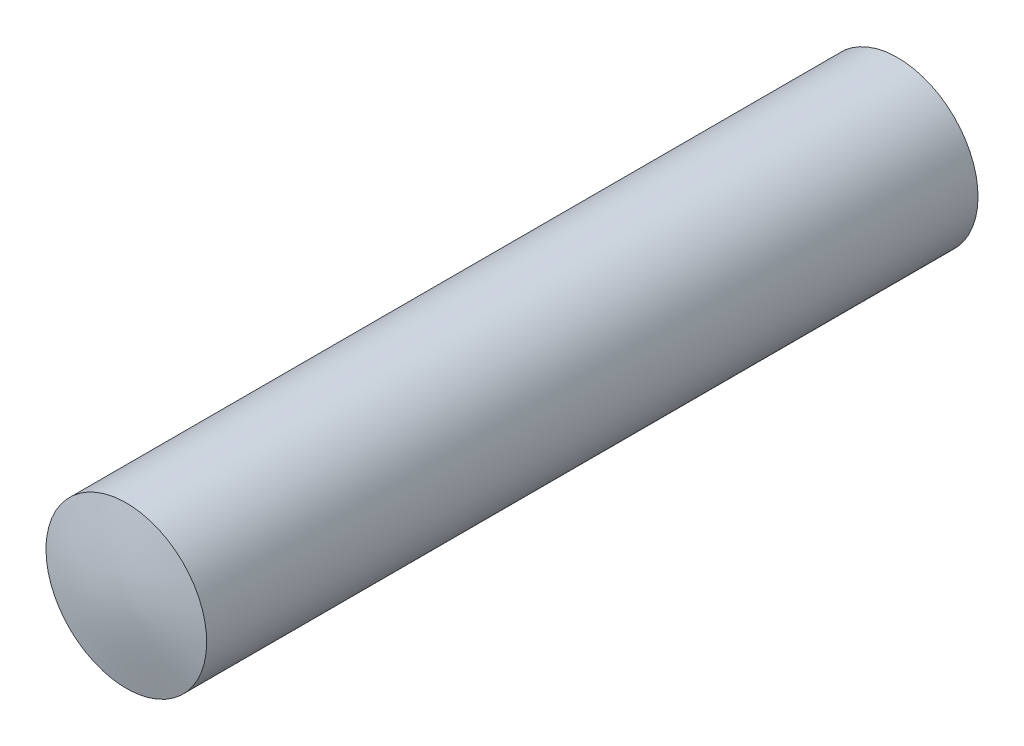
ISO-10303-21;
HEADER;
FILE_DESCRIPTION(('STEP AP214'),'2;1');
FILE_NAME('part.step','',(''),(''),'','','');
FILE_SCHEMA(('AUTOMOTIVE_DESIGN { 1 0 10303 214 1 1 1 1 }'));
ENDSEC;
DATA;
#1=APPLICATION_CONTEXT('core data for automotive mechanical design processes');
#2=APPLICATION_PROTOCOL_DEFINITION('international standard','automotive_design',2000,#1);
#3=PRODUCT_CONTEXT('',#1,'mechanical');
#4=PRODUCT('Part','Part','',(#3));
#5=PRODUCT_RELATED_PRODUCT_CATEGORY('part','',(#4));
#6=PRODUCT_DEFINITION_FORMATION('','',#4);
#7=PRODUCT_DEFINITION_CONTEXT('part definition',#1,'design');
#8=PRODUCT_DEFINITION('design','',#6,#7);
#9=PRODUCT_DEFINITION_SHAPE('','',#8);
#10=(LENGTH_UNIT() NAMED_UNIT(*) SI_UNIT(.MILLI.,.METRE.));
#11=(NAMED_UNIT(*) PLANE_ANGLE_UNIT() SI_UNIT($,.RADIAN.));
#12=(NAMED_UNIT(*) SI_UNIT($,.STERADIAN.) SOLID_ANGLE_UNIT());
#13=UNCERTAINTY_MEASURE_WITH_UNIT(LENGTH_MEASURE(1.E-05),#10,'distance_accuracy_value','');
#14=(GEOMETRIC_REPRESENTATION_CONTEXT(3) GLOBAL_UNCERTAINTY_ASSIGNED_CONTEXT((#13)) GLOBAL_UNIT_ASSIGNED_CONTEXT((#10,
#11,#12)) REPRESENTATION_CONTEXT('',''));
#15=CARTESIAN_POINT('',(0.,0.,0.));
#16=DIRECTION('',(0.,0.,1.));
#17=DIRECTION('',(1.,0.,0.));
#18=AXIS2_PLACEMENT_3D('',#15,#16,#17);
#19=CARTESIAN_POINT('',(0.,0.,7.62));
#20=DIRECTION('',(0.,0.,-1.));
#21=DIRECTION('',(-1.,0.,0.));
#22=AXIS2_PLACEMENT_3D('',#19,#20,#21);
#23=CYLINDRICAL_SURFACE('',#22,1.5875);
#24=CARTESIAN_POINT('',(-1.5875,-1.49262790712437E-11,7.62010571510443));
#25=CARTESIAN_POINT('',(-1.58749604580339,-0.089170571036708,7.62010605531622));
#26=CARTESIAN_POINT('',(-1.57996166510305,-0.178405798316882,7.62011645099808));
#27=CARTESIAN_POINT('',(-1.55001008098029,-0.354418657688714,7.62011473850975));
#28=CARTESIAN_POINT('',(-1.52757496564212,-0.441193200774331,7.62010260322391));
#29=CARTESIAN_POINT('',(-1.46846058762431,-0.609709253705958,7.62010392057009));
#30=CARTESIAN_POINT('',(-1.43178812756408,-0.691453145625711,7.62011736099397));
#31=CARTESIAN_POINT('',(-1.34524940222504,-0.847600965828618,7.62014934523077));
#32=CARTESIAN_POINT('',(-1.29538641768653,-0.922006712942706,7.62016788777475));
#33=CARTESIAN_POINT('',(-1.18387200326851,-1.0614001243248,7.62018769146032));
#34=CARTESIAN_POINT('',(-1.12221934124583,-1.12638680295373,7.62018895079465));
#35=CARTESIAN_POINT('',(-0.988876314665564,-1.24508955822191,7.62017354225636));
#36=CARTESIAN_POINT('',(-0.917185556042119,-1.29880519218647,7.62015687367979));
#37=CARTESIAN_POINT('',(-0.765804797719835,-1.39343708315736,7.62012190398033));
#38=CARTESIAN_POINT('',(-0.686114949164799,-1.43435358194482,7.62010360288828));
#39=CARTESIAN_POINT('',(-0.520997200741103,-1.50222695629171,7.62010309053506));
#40=CARTESIAN_POINT('',(-0.435569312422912,-1.52918385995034,7.62012087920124));
#41=CARTESIAN_POINT('',(-0.26140023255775,-1.56837299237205,7.62014425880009));
#42=CARTESIAN_POINT('',(-0.172659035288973,-1.5806051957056,7.6201498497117));
#43=CARTESIAN_POINT('',(0.00561725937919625,-1.58999759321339,7.6201569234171));
#44=CARTESIAN_POINT('',(0.0951523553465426,-1.58715781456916,7.6201584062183));
#45=CARTESIAN_POINT('',(0.272475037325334,-1.56648691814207,7.6201423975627));
#46=CARTESIAN_POINT('',(0.360262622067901,-1.54865578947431,7.62012490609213));
#47=CARTESIAN_POINT('',(0.531598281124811,-1.4985083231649,7.62010445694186));
#48=CARTESIAN_POINT('',(0.615146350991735,-1.46619197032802,7.62010149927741));
#49=CARTESIAN_POINT('',(0.775631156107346,-1.38799143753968,7.62012015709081));
#50=CARTESIAN_POINT('',(0.852567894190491,-1.34210726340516,7.62014177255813));
#51=CARTESIAN_POINT('',(0.997646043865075,-1.23807361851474,7.62017422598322));
#52=CARTESIAN_POINT('',(1.06578745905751,-1.17992415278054,7.62018506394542));
#53=CARTESIAN_POINT('',(1.19134068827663,-1.05301058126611,7.6201874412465));
#54=CARTESIAN_POINT('',(1.24875249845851,-0.984246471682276,7.62017898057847));
#55=CARTESIAN_POINT('',(1.35121674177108,-0.838055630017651,7.62014913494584));
#56=CARTESIAN_POINT('',(1.3962691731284,-0.760628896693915,7.62012774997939));
#57=CARTESIAN_POINT('',(1.47273574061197,-0.599310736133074,7.62010595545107));
#58=CARTESIAN_POINT('',(1.50414987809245,-0.515419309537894,7.62010554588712));
#59=CARTESIAN_POINT('',(1.55244810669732,-0.343553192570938,7.62010858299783));
#60=CARTESIAN_POINT('',(1.56933219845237,-0.255578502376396,7.62011202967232));
#61=CARTESIAN_POINT('',(1.58809104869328,-0.0780431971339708,7.62011162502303));
#62=CARTESIAN_POINT('',(1.58996580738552,0.0115174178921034,7.62010777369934));
#63=CARTESIAN_POINT('',(1.57865277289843,0.189682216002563,7.62010874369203));
#64=CARTESIAN_POINT('',(1.56546497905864,0.278286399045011,7.6201135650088));
#65=CARTESIAN_POINT('',(1.5244011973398,0.452023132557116,7.62011028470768));
#66=CARTESIAN_POINT('',(1.49652520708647,0.5371556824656,7.62010218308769));
#67=CARTESIAN_POINT('',(1.42687635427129,0.701532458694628,7.62011473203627));
#68=CARTESIAN_POINT('',(1.38510349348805,0.780776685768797,7.62013538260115));
#69=CARTESIAN_POINT('',(1.2888467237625,0.931127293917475,7.62016900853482));
#70=CARTESIAN_POINT('',(1.23436281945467,1.00223367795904,7.62018198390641));
#71=CARTESIAN_POINT('',(1.1142305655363,1.13429016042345,7.62018880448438));
#72=CARTESIAN_POINT('',(1.04858221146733,1.19524025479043,7.62018264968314));
#73=CARTESIAN_POINT('',(0.907984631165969,1.30525393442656,7.6201557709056));
#74=CARTESIAN_POINT('',(0.833035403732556,1.3543175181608,7.62013504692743));
#75=CARTESIAN_POINT('',(0.675963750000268,1.43916535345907,7.62010686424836));
#76=CARTESIAN_POINT('',(0.593841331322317,1.47494961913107,7.62009940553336));
#77=CARTESIAN_POINT('',(0.424754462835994,1.53222307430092,7.62011379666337));
#78=CARTESIAN_POINT('',(0.337790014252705,1.55371226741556,7.62013564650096));
#79=CARTESIAN_POINT('',(0.161487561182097,1.58178560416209,7.62015603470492));
#80=CARTESIAN_POINT('',(0.0721495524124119,1.58836972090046,7.62015457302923));
#81=CARTESIAN_POINT('',(-0.106363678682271,1.58644592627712,7.62015315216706));
#82=CARTESIAN_POINT('',(-0.195538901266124,1.57793803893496,7.62015319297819));
#83=CARTESIAN_POINT('',(-0.371195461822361,1.54607175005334,7.62013109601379));
#84=CARTESIAN_POINT('',(-0.457676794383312,1.52271331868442,7.62010895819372));
#85=CARTESIAN_POINT('',(-0.625491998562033,1.46180847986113,7.62009876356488));
#86=CARTESIAN_POINT('',(-0.706825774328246,1.42426180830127,7.62011070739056));
#87=CARTESIAN_POINT('',(-0.862032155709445,1.3360479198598,7.62014233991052));
#88=CARTESIAN_POINT('',(-0.935905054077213,1.28538121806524,7.62016202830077));
#89=CARTESIAN_POINT('',(-1.07408901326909,1.17237158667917,7.62018551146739));
#90=CARTESIAN_POINT('',(-1.13840107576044,1.11002988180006,7.62018930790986));
#91=CARTESIAN_POINT('',(-1.25566240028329,0.975416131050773,7.62017809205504));
#92=CARTESIAN_POINT('',(-1.30860883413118,0.903141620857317,7.62016307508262));
#93=CARTESIAN_POINT('',(-1.40163627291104,0.75070131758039,7.62012917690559));
#94=CARTESIAN_POINT('',(-1.44171112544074,0.670531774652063,7.62011029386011));
#95=CARTESIAN_POINT('',(-1.50778654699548,0.504665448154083,7.62010167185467));
#96=CARTESIAN_POINT('',(-1.53380398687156,0.418975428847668,7.62011189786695));
#97=CARTESIAN_POINT('',(-1.56409188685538,0.277282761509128,7.6201159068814));
#98=CARTESIAN_POINT('',(-1.57285897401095,0.222200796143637,7.62011441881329));
#99=CARTESIAN_POINT('',(-1.58456426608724,0.111420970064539,7.62010921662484));
#100=CARTESIAN_POINT('',(-1.58750247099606,0.0557231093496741,7.62010550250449));
#101=CARTESIAN_POINT('',(-1.5875,-1.49262790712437E-11,7.62010571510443));
#102=B_SPLINE_CURVE_WITH_KNOTS('',3,(#24,#25,#26,#27,#28,#29,#30,#31,#32,#33,#34,#35,#36,#37,
#38,#39,#40,#41,#42,#43,#44,#45,#46,#47,#48,#49,#50,#51,#52,#53,#54,#55,#56,#57,#58,#59,#60,#61,
#62,#63,#64,#65,#66,#67,#68,#69,#70,#71,#72,#73,#74,#75,#76,#77,#78,#79,#80,#81,#82,#83,#84,#85,
#86,#87,#88,#89,#90,#91,#92,#93,#94,#95,#96,#97,#98,#99,#100,#101),.UNSPECIFIED.,.T.,.F.,(4,2,2,
2,2,2,2,2,2,2,2,2,2,2,2,2,2,2,2,2,2,2,2,2,2,2,2,2,2,2,2,2,2,2,2,2,2,2,4),(0.,0.267308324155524,
0.534938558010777,0.802441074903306,1.06987712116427,1.33734113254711,1.60481564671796,
1.87228510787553,2.13975403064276,2.40722341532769,2.67469231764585,2.94216141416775,
3.20963079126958,3.4771000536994,3.74456920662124,4.01203845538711,4.27950774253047,
4.54697700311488,4.8144462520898,5.08191549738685,5.34938475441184,5.61685405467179,
5.88432332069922,6.15179248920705,6.41926176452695,6.68673107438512,6.95420010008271,
7.22166905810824,7.48913849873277,7.75660751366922,8.02407706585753,8.29155159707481,
8.55901562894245,8.8264516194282,9.09395408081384,9.36158421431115,9.628892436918,
9.79593466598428,9.96297689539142),.UNSPECIFIED.);
#103=CARTESIAN_POINT('',(-1.5875,-1.49262790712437E-11,7.62010571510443));
#104=VERTEX_POINT('',#103);
#105=EDGE_CURVE('E12',#104,#104,#102,.T.);
#106=ORIENTED_EDGE('',*,*,#105,.F.);
#107=EDGE_LOOP('',(#106));
#108=FACE_BOUND('',#107,.T.);
#109=CARTESIAN_POINT('',(-1.5875,1.50157121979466E-11,-7.62010571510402));
#110=CARTESIAN_POINT('',(-1.58749604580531,-0.0891705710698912,-7.62010608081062));
#111=CARTESIAN_POINT('',(-1.57996166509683,-0.178405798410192,-7.62011650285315));
#112=CARTESIAN_POINT('',(-1.55001008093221,-0.35441865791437,-7.62011489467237));
#113=CARTESIAN_POINT('',(-1.52757496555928,-0.441193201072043,-7.62010283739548));
#114=CARTESIAN_POINT('',(-1.46846058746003,-0.60970925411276,-7.620104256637));
#115=CARTESIAN_POINT('',(-1.43178812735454,-0.691453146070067,-7.62011772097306));
#116=CARTESIAN_POINT('',(-1.34524940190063,-0.847600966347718,-7.62014965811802));
#117=CARTESIAN_POINT('',(-1.29538641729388,-0.922006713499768,-7.62016812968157));
#118=CARTESIAN_POINT('',(-1.18387200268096,-1.06140012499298,-7.62018774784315));
#119=CARTESIAN_POINT('',(-1.12221934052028,-1.12638680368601,-7.62018889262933));
#120=CARTESIAN_POINT('',(-0.988876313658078,-1.24508955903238,-7.620173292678));
#121=CARTESIAN_POINT('',(-0.91718555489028,-1.29880519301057,-7.620156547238));
#122=CARTESIAN_POINT('',(-0.765804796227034,-1.39343708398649,-7.62012151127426));
#123=CARTESIAN_POINT('',(-0.686114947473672,-1.43435358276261,-7.62010322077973));
#124=CARTESIAN_POINT('',(-0.520997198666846,-1.50222695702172,-7.62010279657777));
#125=CARTESIAN_POINT('',(-0.435569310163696,-1.52918386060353,-7.62012066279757));
#126=CARTESIAN_POINT('',(-0.261400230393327,-1.56837299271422,-7.62014416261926));
#127=CARTESIAN_POINT('',(-0.172659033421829,-1.58060519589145,-7.6201497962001));
#128=CARTESIAN_POINT('',(0.00561726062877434,-1.58999759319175,-7.6201569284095));
#129=CARTESIAN_POINT('',(0.0951523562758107,-1.58715781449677,-7.62015842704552));
#130=CARTESIAN_POINT('',(0.272475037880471,-1.56648691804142,-7.62014249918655));
#131=CARTESIAN_POINT('',(0.360262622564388,-1.54865578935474,-7.62012507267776));
#132=CARTESIAN_POINT('',(0.531598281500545,-1.49850832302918,-7.62010474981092));
#133=CARTESIAN_POINT('',(0.61514635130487,-1.4661919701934,-7.62010185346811));
#134=CARTESIAN_POINT('',(0.77563115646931,-1.38799143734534,-7.62012054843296));
#135=CARTESIAN_POINT('',(0.852567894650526,-1.3421072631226,-7.62014213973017));
#136=CARTESIAN_POINT('',(0.99764604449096,-1.23807361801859,-7.62017446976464));
#137=CARTESIAN_POINT('',(1.06578745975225,-1.17992415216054,-7.62018520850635));
#138=CARTESIAN_POINT('',(1.19134068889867,-1.05301058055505,-7.62018737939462));
#139=CARTESIAN_POINT('',(1.24875249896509,-0.984246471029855,-7.62017881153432));
#140=CARTESIAN_POINT('',(1.35121674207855,-0.838055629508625,-7.62014881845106));
#141=CARTESIAN_POINT('',(1.39626917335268,-0.760628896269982,-7.62012739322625));
#142=CARTESIAN_POINT('',(1.47273574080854,-0.59931073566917,-7.6201056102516));
#143=CARTESIAN_POINT('',(1.50414987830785,-0.515419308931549,-7.62010525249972));
#144=CARTESIAN_POINT('',(1.55244810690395,-0.34355319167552,-7.62010840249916));
#145=CARTESIAN_POINT('',(1.56933219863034,-0.255578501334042,-7.62011191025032));
#146=CARTESIAN_POINT('',(1.58809104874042,-0.0780431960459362,-7.62011159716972));
#147=CARTESIAN_POINT('',(1.5899658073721,0.0115174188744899,-7.62010777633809));
#148=CARTESIAN_POINT('',(1.57865277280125,0.189682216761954,-7.62010882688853));
#149=CARTESIAN_POINT('',(1.56546497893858,0.278286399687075,-7.62011369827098));
#150=CARTESIAN_POINT('',(1.52440119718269,0.452023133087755,-7.62011053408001));
#151=CARTESIAN_POINT('',(1.49652520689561,0.537155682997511,-7.62010249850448));
#152=CARTESIAN_POINT('',(1.42687635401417,0.701532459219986,-7.62011509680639));
#153=CARTESIAN_POINT('',(1.3851034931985,0.78077668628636,-7.62013573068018));
#154=CARTESIAN_POINT('',(1.28884672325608,0.931127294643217,-7.62016924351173));
#155=CARTESIAN_POINT('',(1.23436281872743,1.00223367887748,-7.6201821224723));
#156=CARTESIAN_POINT('',(1.11423056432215,1.13429016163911,-7.62018873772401));
#157=CARTESIAN_POINT('',(1.04858220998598,1.19524025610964,-7.62018247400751));
#158=CARTESIAN_POINT('',(0.907984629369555,1.30525393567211,-7.62015543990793));
#159=CARTESIAN_POINT('',(0.833035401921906,1.35431751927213,-7.62013466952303));
#160=CARTESIAN_POINT('',(0.675963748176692,1.4391653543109,-7.62010648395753));
#161=CARTESIAN_POINT('',(0.593841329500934,1.47494961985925,-7.62009906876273));
#162=CARTESIAN_POINT('',(0.424754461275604,1.53222307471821,-7.62011357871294));
#163=CARTESIAN_POINT('',(0.337790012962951,1.55371226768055,-7.62013550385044));
#164=CARTESIAN_POINT('',(0.161487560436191,1.58178560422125,-7.62015599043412));
#165=CARTESIAN_POINT('',(0.0721495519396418,1.58836972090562,-7.62015455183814));
#166=CARTESIAN_POINT('',(-0.10636367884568,1.5864459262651,-7.62015318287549));
#167=CARTESIAN_POINT('',(-0.195538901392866,1.57793803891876,-7.62015325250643));
#168=CARTESIAN_POINT('',(-0.371195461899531,1.54607175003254,-7.62013126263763));
#169=CARTESIAN_POINT('',(-0.457676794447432,1.52271331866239,-7.62010920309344));
#170=CARTESIAN_POINT('',(-0.62549199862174,1.46180847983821,-7.62009911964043));
#171=CARTESIAN_POINT('',(-0.706825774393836,1.42426180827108,-7.62011109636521));
#172=CARTESIAN_POINT('',(-0.862032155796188,1.3360479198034,-7.62014270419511));
#173=CARTESIAN_POINT('',(-0.935905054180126,1.28538121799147,-7.62016233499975));
#174=CARTESIAN_POINT('',(-1.07408901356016,1.17237158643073,-7.62018564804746));
#175=CARTESIAN_POINT('',(-1.13840107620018,1.11002988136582,-7.62018933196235));
#176=CARTESIAN_POINT('',(-1.25566240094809,0.975416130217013,-7.62017791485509));
#177=CARTESIAN_POINT('',(-1.30860883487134,0.903141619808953,-7.62016280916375));
#178=CARTESIAN_POINT('',(-1.40163627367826,0.750701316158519,-7.62012882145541));
#179=CARTESIAN_POINT('',(-1.44171112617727,0.670531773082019,-7.62010993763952));
#180=CARTESIAN_POINT('',(-1.50778654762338,0.504665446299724,-7.6201013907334));
#181=CARTESIAN_POINT('',(-1.53380398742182,0.418975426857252,-7.62011169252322));
#182=CARTESIAN_POINT('',(-1.56409188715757,0.277282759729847,-7.62011579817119));
#183=CARTESIAN_POINT('',(-1.57285897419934,0.222200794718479,-7.62011434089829));
#184=CARTESIAN_POINT('',(-1.58456426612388,0.111420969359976,-7.62010918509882));
#185=CARTESIAN_POINT('',(-1.58750247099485,0.0557231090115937,-7.62010548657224));
#186=CARTESIAN_POINT('',(-1.5875,1.50157121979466E-11,-7.62010571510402));
#187=B_SPLINE_CURVE_WITH_KNOTS('',3,(#109,#110,#111,#112,#113,#114,#115,#116,#117,#118,#119,
#120,#121,#122,#123,#124,#125,#126,#127,#128,#129,#130,#131,#132,#133,#134,#135,#136,#137,#138,
#139,#140,#141,#142,#143,#144,#145,#146,#147,#148,#149,#150,#151,#152,#153,#154,#155,#156,#157,
#158,#159,#160,#161,#162,#163,#164,#165,#166,#167,#168,#169,#170,#171,#172,#173,#174,#175,#176,
#177,#178,#179,#180,#181,#182,#183,#184,#185,#186),.UNSPECIFIED.,.T.,.F.,(4,2,2,2,2,2,2,2,2,2,2,
2,2,2,2,2,2,2,2,2,2,2,2,2,2,2,2,2,2,2,2,2,2,2,2,2,2,2,4),(0.,0.267308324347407,
0.534938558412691,0.802441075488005,1.06987712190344,1.33734113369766,1.60481564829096,
1.87228510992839,2.13975403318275,2.40722341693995,2.6746923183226,2.94216141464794,
3.20963079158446,3.47710005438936,3.74456920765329,4.01203845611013,4.27950774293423,
4.54697700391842,4.81444625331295,5.08191549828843,5.34938475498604,5.61685405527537,
5.88432332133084,6.15179249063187,6.41926176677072,6.68673107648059,6.95420010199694,
7.22166905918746,7.48913849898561,7.756607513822,8.02407706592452,8.29155159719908,
8.55901562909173,8.82645162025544,9.09395408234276,9.36158421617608,9.62889243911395,
9.79593466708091,9.96297689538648),.UNSPECIFIED.);
#188=CARTESIAN_POINT('',(-1.5875,1.50157121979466E-11,-7.62010571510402));
#189=VERTEX_POINT('',#188);
#190=EDGE_CURVE('E107',#189,#189,#187,.T.);
#191=ORIENTED_EDGE('',*,*,#190,.T.);
#192=EDGE_LOOP('',(#191));
#193=FACE_BOUND('',#192,.T.);
#194=ADVANCED_FACE('F93',(#108,#193),#23,.T.);
#195=CARTESIAN_POINT('',(1.68852205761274,-1.61923509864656,7.46647886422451));
#196=CARTESIAN_POINT('',(1.41835918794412,-1.61923509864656,7.50349513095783));
#197=CARTESIAN_POINT('',(1.1481963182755,-1.61923509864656,7.53716691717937));
#198=CARTESIAN_POINT('',(0.878033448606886,-1.61923509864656,7.56853974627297));
#199=CARTESIAN_POINT('',(0.472788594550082,-1.61923509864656,7.60455187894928));
#200=CARTESIAN_POINT('',(0.0675437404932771,-1.61923509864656,7.61450699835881));
#201=CARTESIAN_POINT('',(-0.0675382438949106,-1.61923509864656,7.61450705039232));
#202=CARTESIAN_POINT('',(-0.472784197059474,-1.61923509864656,7.60455237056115));
#203=CARTESIAN_POINT('',(-0.878030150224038,-1.61923509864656,7.56854089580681));
#204=CARTESIAN_POINT('',(-1.14819411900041,-1.61923509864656,7.53716801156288));
#205=CARTESIAN_POINT('',(-1.41835808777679,-1.61923509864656,7.50349578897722));
#206=CARTESIAN_POINT('',(-1.68852205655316,-1.61923509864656,7.46647897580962));
#207=CARTESIAN_POINT('',(1.68852205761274,-1.3601581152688,7.49956971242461));
#208=CARTESIAN_POINT('',(1.41835918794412,-1.3601581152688,7.54241339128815));
#209=CARTESIAN_POINT('',(1.1481963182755,-1.3601581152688,7.58186378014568));
#210=CARTESIAN_POINT('',(0.878033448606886,-1.3601581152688,7.61925920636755));
#211=CARTESIAN_POINT('',(0.472788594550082,-1.3601581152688,7.66243648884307));
#212=CARTESIAN_POINT('',(0.0675437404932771,-1.3601581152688,7.6743944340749));
#213=CARTESIAN_POINT('',(-0.0675382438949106,-1.3601581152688,7.67439451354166));
#214=CARTESIAN_POINT('',(-0.472784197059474,-1.3601581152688,7.66243705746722));
#215=CARTESIAN_POINT('',(-0.878030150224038,-1.3601581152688,7.6192602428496));
#216=CARTESIAN_POINT('',(-1.14819411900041,-1.3601581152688,7.58186447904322));
#217=CARTESIAN_POINT('',(-1.41835808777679,-1.3601581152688,7.54241361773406));
#218=CARTESIAN_POINT('',(-1.68852205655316,-1.3601581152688,7.49956935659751));
#219=CARTESIAN_POINT('',(1.68852205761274,-1.10108113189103,7.52958784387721));
#220=CARTESIAN_POINT('',(1.41835918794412,-1.10108113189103,7.57821300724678));
#221=CARTESIAN_POINT('',(1.1481963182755,-1.10108113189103,7.62334626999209));
#222=CARTESIAN_POINT('',(0.878033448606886,-1.10108113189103,7.6669804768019));
#223=CARTESIAN_POINT('',(0.472788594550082,-1.10108113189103,7.71755669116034));
#224=CARTESIAN_POINT('',(0.0675437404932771,-1.10108113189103,7.73158371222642));
#225=CARTESIAN_POINT('',(-0.0675382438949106,-1.10108113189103,7.73158380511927));
#226=CARTESIAN_POINT('',(-0.472784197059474,-1.10108113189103,7.71755739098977));
#227=CARTESIAN_POINT('',(-0.878030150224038,-1.10108113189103,7.66698130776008));
#228=CARTESIAN_POINT('',(-1.14819411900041,-1.10108113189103,7.62334665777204));
#229=CARTESIAN_POINT('',(-1.41835808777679,-1.10108113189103,7.57821287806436));
#230=CARTESIAN_POINT('',(-1.68852205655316,-1.10108113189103,7.52958709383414));
#231=CARTESIAN_POINT('',(1.68852205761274,-0.842004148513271,7.55746306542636));
#232=CARTESIAN_POINT('',(1.41835918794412,-0.842004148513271,7.61212603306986));
#233=CARTESIAN_POINT('',(1.1481963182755,-0.842004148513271,7.66347618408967));
#234=CARTESIAN_POINT('',(0.878033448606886,-0.842004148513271,7.71390778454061));
#235=CARTESIAN_POINT('',(0.472788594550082,-0.842004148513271,7.77144811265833));
#236=CARTESIAN_POINT('',(0.0675437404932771,-0.842004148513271,7.78758952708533));
#237=CARTESIAN_POINT('',(-0.0675382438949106,-0.842004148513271,7.78758963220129));
#238=CARTESIAN_POINT('',(-0.472784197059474,-0.842004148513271,7.77144871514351));
#239=CARTESIAN_POINT('',(-0.878030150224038,-0.842004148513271,7.7139084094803));
#240=CARTESIAN_POINT('',(-1.14819411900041,-0.842004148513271,7.66347626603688));
#241=CARTESIAN_POINT('',(-1.41835808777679,-0.842004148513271,7.61212566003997));
#242=CARTESIAN_POINT('',(-1.68852205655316,-0.842004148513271,7.557462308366));
#243=CARTESIAN_POINT('',(1.68852205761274,-0.453388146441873,7.58919472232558));
#244=CARTESIAN_POINT('',(1.41835918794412,-0.453388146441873,7.65114261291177));
#245=CARTESIAN_POINT('',(1.1481963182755,-0.453388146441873,7.71004858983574));
#246=CARTESIAN_POINT('',(0.878033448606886,-0.453388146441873,7.7675507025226));
#247=CARTESIAN_POINT('',(0.472788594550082,-0.453388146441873,7.83835259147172));
#248=CARTESIAN_POINT('',(0.0675437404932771,-0.453388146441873,7.85853533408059));
#249=CARTESIAN_POINT('',(-0.0675382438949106,-0.453388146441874,7.85853544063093));
#250=CARTESIAN_POINT('',(-0.472784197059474,-0.453388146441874,7.83835327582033));
#251=CARTESIAN_POINT('',(-0.878030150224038,-0.453388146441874,7.76755132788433));
#252=CARTESIAN_POINT('',(-1.14819411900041,-0.453388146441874,7.71004885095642));
#253=CARTESIAN_POINT('',(-1.41835808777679,-0.453388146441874,7.6511427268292));
#254=CARTESIAN_POINT('',(-1.68852205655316,-0.453388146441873,7.58919455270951));
#255=CARTESIAN_POINT('',(1.68852205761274,-0.064772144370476,7.59788540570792));
#256=CARTESIAN_POINT('',(1.41835918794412,-0.064772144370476,7.66189021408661));
#257=CARTESIAN_POINT('',(1.1481963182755,-0.064772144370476,7.72296639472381));
#258=CARTESIAN_POINT('',(0.878033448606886,-0.064772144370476,7.78262864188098));
#259=CARTESIAN_POINT('',(0.472788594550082,-0.064772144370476,7.85748386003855));
#260=CARTESIAN_POINT('',(0.0675437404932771,-0.064772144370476,7.8806462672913));
#261=CARTESIAN_POINT('',(-0.0675382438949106,-0.064772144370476,7.88064640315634));
#262=CARTESIAN_POINT('',(-0.472784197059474,-0.064772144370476,7.85748460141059));
#263=CARTESIAN_POINT('',(-0.878030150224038,-0.064772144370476,7.78262936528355));
#264=CARTESIAN_POINT('',(-1.14819411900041,-0.064772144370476,7.72296688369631));
#265=CARTESIAN_POINT('',(-1.41835808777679,-0.064772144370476,7.66189045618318));
#266=CARTESIAN_POINT('',(-1.68852205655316,-0.064772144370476,7.597885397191));
#267=CARTESIAN_POINT('',(1.68852205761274,0.064766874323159,7.59788543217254));
#268=CARTESIAN_POINT('',(1.41835918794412,0.064766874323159,7.66189024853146));
#269=CARTESIAN_POINT('',(1.1481963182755,0.064766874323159,7.72296646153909));
#270=CARTESIAN_POINT('',(0.878033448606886,0.064766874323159,7.78262870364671));
#271=CARTESIAN_POINT('',(0.472788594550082,0.064766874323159,7.85748396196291));
#272=CARTESIAN_POINT('',(0.0675437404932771,0.064766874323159,7.88064639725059));
#273=CARTESIAN_POINT('',(-0.0675382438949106,0.064766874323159,7.88064653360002));
#274=CARTESIAN_POINT('',(-0.472784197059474,0.064766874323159,7.85748470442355));
#275=CARTESIAN_POINT('',(-0.878030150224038,0.064766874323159,7.78262946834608));
#276=CARTESIAN_POINT('',(-1.14819411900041,0.064766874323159,7.72296696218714));
#277=CARTESIAN_POINT('',(-1.41835808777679,0.064766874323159,7.66189052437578));
#278=CARTESIAN_POINT('',(-1.68852205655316,0.064766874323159,7.59788544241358));
#279=CARTESIAN_POINT('',(1.68852205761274,0.453383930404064,7.5891948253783));
#280=CARTESIAN_POINT('',(1.41835918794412,0.453383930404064,7.65114283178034));
#281=CARTESIAN_POINT('',(1.1481963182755,0.453383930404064,7.71004881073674));
#282=CARTESIAN_POINT('',(0.878033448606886,0.453383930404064,7.7675511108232));
#283=CARTESIAN_POINT('',(0.472788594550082,0.453383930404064,7.83835323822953));
#284=CARTESIAN_POINT('',(0.0675437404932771,0.453383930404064,7.858536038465));
#285=CARTESIAN_POINT('',(-0.0675382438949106,0.453383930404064,7.85853614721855));
#286=CARTESIAN_POINT('',(-0.472784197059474,0.453383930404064,7.83835393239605));
#287=CARTESIAN_POINT('',(-0.878030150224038,0.453383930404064,7.76755192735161));
#288=CARTESIAN_POINT('',(-1.14819411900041,0.453383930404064,7.7100495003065));
#289=CARTESIAN_POINT('',(-1.41835808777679,0.453383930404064,7.65114322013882));
#290=CARTESIAN_POINT('',(-1.68852205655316,0.453383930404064,7.58919499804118));
#291=CARTESIAN_POINT('',(1.68852205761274,0.842000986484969,7.55746265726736));
#292=CARTESIAN_POINT('',(1.41835918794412,0.842000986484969,7.61212586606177));
#293=CARTESIAN_POINT('',(1.1481963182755,0.842000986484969,7.66347635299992));
#294=CARTESIAN_POINT('',(0.878033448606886,0.842000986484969,7.71390836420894));
#295=CARTESIAN_POINT('',(0.472788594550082,0.842000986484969,7.77144885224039));
#296=CARTESIAN_POINT('',(0.0675437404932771,0.842000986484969,7.78759024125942));
#297=CARTESIAN_POINT('',(-0.0675382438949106,0.842000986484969,7.78759031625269));
#298=CARTESIAN_POINT('',(-0.472784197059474,0.842000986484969,7.77144932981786));
#299=CARTESIAN_POINT('',(-0.878030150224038,0.842000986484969,7.71390899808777));
#300=CARTESIAN_POINT('',(-1.14819411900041,0.842000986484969,7.6634771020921));
#301=CARTESIAN_POINT('',(-1.41835808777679,0.842000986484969,7.61212668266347));
#302=CARTESIAN_POINT('',(-1.68852205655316,0.842000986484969,7.55746341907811));
#303=CARTESIAN_POINT('',(1.68852205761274,1.10107902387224,7.52958733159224));
#304=CARTESIAN_POINT('',(1.41835918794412,1.10107902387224,7.57821296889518));
#305=CARTESIAN_POINT('',(1.1481963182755,1.10107902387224,7.62334662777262));
#306=CARTESIAN_POINT('',(0.878033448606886,1.10107902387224,7.66698115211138));
#307=CARTESIAN_POINT('',(0.472788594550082,1.10107902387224,7.71755735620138));
#308=CARTESIAN_POINT('',(0.0675437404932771,1.10107902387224,7.7315841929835));
#309=CARTESIAN_POINT('',(-0.0675382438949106,1.10107902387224,7.73158425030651));
#310=CARTESIAN_POINT('',(-0.472784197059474,1.10107902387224,7.71755761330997));
#311=CARTESIAN_POINT('',(-0.878030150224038,1.10107902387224,7.66698140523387));
#312=CARTESIAN_POINT('',(-1.14819411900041,1.10107902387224,7.62334696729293));
#313=CARTESIAN_POINT('',(-1.41835808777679,1.10107902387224,7.57821348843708));
#314=CARTESIAN_POINT('',(-1.68852205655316,1.10107902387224,7.52958808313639));
#315=CARTESIAN_POINT('',(1.68852205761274,1.36015706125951,7.49956948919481));
#316=CARTESIAN_POINT('',(1.41835918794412,1.36015706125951,7.5424136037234));
#317=CARTESIAN_POINT('',(1.1481963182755,1.36015706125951,7.58186434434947));
#318=CARTESIAN_POINT('',(0.878033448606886,1.36015706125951,7.61925998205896));
#319=CARTESIAN_POINT('',(0.472788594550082,1.36015706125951,7.66243688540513));
#320=CARTESIAN_POINT('',(0.0675437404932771,1.36015706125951,7.67439468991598));
#321=CARTESIAN_POINT('',(-0.0675382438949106,1.36015706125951,7.67439474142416));
#322=CARTESIAN_POINT('',(-0.472784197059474,1.36015706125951,7.6624371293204));
#323=CARTESIAN_POINT('',(-0.878030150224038,1.36015706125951,7.6192598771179));
#324=CARTESIAN_POINT('',(-1.14819411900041,1.36015706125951,7.58186427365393));
#325=CARTESIAN_POINT('',(-1.41835808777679,1.36015706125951,7.54241371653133));
#326=CARTESIAN_POINT('',(-1.68852205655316,1.36015706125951,7.49956984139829));
#327=CARTESIAN_POINT('',(1.68852205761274,1.61923509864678,7.46647897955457));
#328=CARTESIAN_POINT('',(1.41835918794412,1.61923509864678,7.50349564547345));
#329=CARTESIAN_POINT('',(1.1481963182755,1.61923509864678,7.53716774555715));
#330=CARTESIAN_POINT('',(0.878033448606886,1.61923509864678,7.56854050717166));
#331=CARTESIAN_POINT('',(0.472788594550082,1.61923509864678,7.60455203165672));
#332=CARTESIAN_POINT('',(0.0675437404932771,1.61923509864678,7.61450699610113));
#333=CARTESIAN_POINT('',(-0.0675382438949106,1.61923509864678,7.61450705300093));
#334=CARTESIAN_POINT('',(-0.472784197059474,1.61923509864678,7.6045522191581));
#335=CARTESIAN_POINT('',(-0.878030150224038,1.61923509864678,7.56854013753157));
#336=CARTESIAN_POINT('',(-1.14819411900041,1.61923509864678,7.5371671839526));
#337=CARTESIAN_POINT('',(-1.41835808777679,1.61923509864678,7.50349527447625));
#338=CARTESIAN_POINT('',(-1.68852205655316,1.61923509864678,7.46647885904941));
#339=B_SPLINE_SURFACE_WITH_KNOTS('',5,5,((#195,#196,#197,#198,#199,#200,#201,#202,#203,#204,
#205,#206),(#207,#208,#209,#210,#211,#212,#213,#214,#215,#216,#217,#218),(#219,#220,#221,#222,
#223,#224,#225,#226,#227,#228,#229,#230),(#231,#232,#233,#234,#235,#236,#237,#238,#239,#240,
#241,#242),(#243,#244,#245,#246,#247,#248,#249,#250,#251,#252,#253,#254),(#255,#256,#257,#258,
#259,#260,#261,#262,#263,#264,#265,#266),(#267,#268,#269,#270,#271,#272,#273,#274,#275,#276,
#277,#278),(#279,#280,#281,#282,#283,#284,#285,#286,#287,#288,#289,#290),(#291,#292,#293,#294,
#295,#296,#297,#298,#299,#300,#301,#302),(#303,#304,#305,#306,#307,#308,#309,#310,#311,#312,
#313,#314),(#315,#316,#317,#318,#319,#320,#321,#322,#323,#324,#325,#326),(#327,#328,#329,#330,
#331,#332,#333,#334,#335,#336,#337,#338)),.UNSPECIFIED.,.F.,.F.,.F.,(6,3,3,6),(6,3,3,6),
(-1.6192350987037,-0.323850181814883,0.323844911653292,1.61923509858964),(-1.68852205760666,
-0.337707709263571,0.337702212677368,1.68852205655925),.UNSPECIFIED.);
#340=ORIENTED_EDGE('',*,*,#105,.T.);
#341=EDGE_LOOP('',(#340));
#342=FACE_BOUND('',#341,.T.);
#343=ADVANCED_FACE('F95',(#342),#339,.T.);
#344=CARTESIAN_POINT('',(1.6885220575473,-1.61923509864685,-7.46647898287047));
#345=CARTESIAN_POINT('',(1.41835918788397,-1.61923509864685,-7.50349564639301));
#346=CARTESIAN_POINT('',(1.14819631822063,-1.61923509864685,-7.53716774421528));
#347=CARTESIAN_POINT('',(0.878033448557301,-1.61923509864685,-7.56854050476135));
#348=CARTESIAN_POINT('',(0.472788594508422,-1.61923509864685,-7.60455203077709));
#349=CARTESIAN_POINT('',(0.0675437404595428,-1.61923509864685,-7.61450699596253));
#350=CARTESIAN_POINT('',(-0.0675382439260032,-1.61923509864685,-7.6145070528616));
#351=CARTESIAN_POINT('',(-0.472784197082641,-1.61923509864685,-7.60455221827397));
#352=CARTESIAN_POINT('',(-0.878030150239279,-1.61923509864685,-7.56854013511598));
#353=CARTESIAN_POINT('',(-1.14819411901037,-1.61923509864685,-7.53716718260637));
#354=CARTESIAN_POINT('',(-1.41835808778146,-1.61923509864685,-7.50349527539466));
#355=CARTESIAN_POINT('',(-1.68852205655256,-1.61923509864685,-7.46647886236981));
#356=CARTESIAN_POINT('',(1.6885220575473,-1.36015811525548,-7.4995693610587));
#357=CARTESIAN_POINT('',(1.41835918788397,-1.36015811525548,-7.54241344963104));
#358=CARTESIAN_POINT('',(1.14819631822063,-1.36015811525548,-7.58186416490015));
#359=CARTESIAN_POINT('',(0.8780334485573,-1.36015811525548,-7.61925977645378));
#360=CARTESIAN_POINT('',(0.472788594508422,-1.36015811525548,-7.66243665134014));
#361=CARTESIAN_POINT('',(0.0675437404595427,-1.36015811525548,-7.67439444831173));
#362=CARTESIAN_POINT('',(-0.0675382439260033,-1.36015811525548,-7.67439449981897));
#363=CARTESIAN_POINT('',(-0.472784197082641,-1.36015811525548,-7.66243689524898));
#364=CARTESIAN_POINT('',(-0.87803015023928,-1.36015811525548,-7.61925967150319));
#365=CARTESIAN_POINT('',(-1.14819411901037,-1.36015811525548,-7.58186409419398));
#366=CARTESIAN_POINT('',(-1.41835808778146,-1.36015811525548,-7.5424135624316));
#367=CARTESIAN_POINT('',(-1.68852205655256,-1.36015811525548,-7.49956971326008));
#368=CARTESIAN_POINT('',(1.6885220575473,-1.10108113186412,-7.5295870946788));
#369=CARTESIAN_POINT('',(1.41835918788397,-1.10108113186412,-7.57821268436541));
#370=CARTESIAN_POINT('',(1.14819631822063,-1.10108113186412,-7.62334629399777));
#371=CARTESIAN_POINT('',(0.8780334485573,-1.10108113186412,-7.66698076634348));
#372=CARTESIAN_POINT('',(0.472788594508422,-1.10108113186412,-7.71755691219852));
#373=CARTESIAN_POINT('',(0.0675437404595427,-1.10108113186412,-7.73158373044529));
#374=CARTESIAN_POINT('',(-0.0675382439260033,-1.10108113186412,-7.73158378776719));
#375=CARTESIAN_POINT('',(-0.472784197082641,-1.10108113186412,-7.71755716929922));
#376=CARTESIAN_POINT('',(-0.87803015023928,-1.10108113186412,-7.66698101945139));
#377=CARTESIAN_POINT('',(-1.14819411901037,-1.10108113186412,-7.62334663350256));
#378=CARTESIAN_POINT('',(-1.41835808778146,-1.10108113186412,-7.57821320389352));
#379=CARTESIAN_POINT('',(-1.68852205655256,-1.10108113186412,-7.52958784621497));
#380=CARTESIAN_POINT('',(1.6885220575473,-0.842004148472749,-7.55746231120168));
#381=CARTESIAN_POINT('',(1.41835918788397,-0.842004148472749,-7.61212544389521));
#382=CARTESIAN_POINT('',(1.14819631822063,-0.842004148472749,-7.6634758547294));
#383=CARTESIAN_POINT('',(0.8780334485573,-0.842004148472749,-7.7139077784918));
#384=CARTESIAN_POINT('',(0.472788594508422,-0.842004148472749,-7.77144817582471));
#385=CARTESIAN_POINT('',(0.0675437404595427,-0.842004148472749,-7.78758954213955));
#386=CARTESIAN_POINT('',(-0.0675382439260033,-0.842004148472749,-7.78758961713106));
#387=CARTESIAN_POINT('',(-0.472784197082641,-0.842004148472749,-7.77144865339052));
#388=CARTESIAN_POINT('',(-0.87803015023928,-0.842004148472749,-7.71390841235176));
#389=CARTESIAN_POINT('',(-1.14819411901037,-0.842004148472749,-7.66347660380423));
#390=CARTESIAN_POINT('',(-1.41835808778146,-0.842004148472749,-7.61212626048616));
#391=CARTESIAN_POINT('',(-1.68852205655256,-0.842004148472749,-7.55746307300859));
#392=CARTESIAN_POINT('',(1.6885220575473,-0.453388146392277,-7.58919452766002));
#393=CARTESIAN_POINT('',(1.41835918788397,-0.453388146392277,-7.65114246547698));
#394=CARTESIAN_POINT('',(1.14819631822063,-0.453388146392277,-7.71004837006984));
#395=CARTESIAN_POINT('',(0.8780334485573,-0.453388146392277,-7.76755060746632));
#396=CARTESIAN_POINT('',(0.472788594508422,-0.453388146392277,-7.8383525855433));
#397=CARTESIAN_POINT('',(0.0675437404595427,-0.453388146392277,-7.85853533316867));
#398=CARTESIAN_POINT('',(-0.0675382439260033,-0.453388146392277,-7.8585354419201));
#399=CARTESIAN_POINT('',(-0.472784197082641,-0.453388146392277,-7.83835327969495));
#400=CARTESIAN_POINT('',(-0.87803015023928,-0.453388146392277,-7.76755142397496));
#401=CARTESIAN_POINT('',(-1.14819411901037,-0.453388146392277,-7.71004905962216));
#402=CARTESIAN_POINT('',(-1.41835808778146,-0.453388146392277,-7.65114285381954));
#403=CARTESIAN_POINT('',(-1.68852205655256,-0.453388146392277,-7.58919470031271));
#404=CARTESIAN_POINT('',(1.6885220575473,-0.064772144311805,-7.59788538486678));
#405=CARTESIAN_POINT('',(1.41835918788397,-0.064772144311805,-7.66189018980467));
#406=CARTESIAN_POINT('',(1.14819631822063,-0.064772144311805,-7.72296639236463));
#407=CARTESIAN_POINT('',(0.8780334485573,-0.064772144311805,-7.78262861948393));
#408=CARTESIAN_POINT('',(0.472788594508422,-0.064772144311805,-7.85748386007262));
#409=CARTESIAN_POINT('',(0.0675437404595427,-0.064772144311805,-7.88064626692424));
#410=CARTESIAN_POINT('',(-0.0675382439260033,-0.064772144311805,-7.88064640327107));
#411=CARTESIAN_POINT('',(-0.472784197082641,-0.064772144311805,-7.85748460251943));
#412=CARTESIAN_POINT('',(-0.87803015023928,-0.064772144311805,-7.78262938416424));
#413=CARTESIAN_POINT('',(-1.14819411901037,-0.064772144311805,-7.72296689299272));
#414=CARTESIAN_POINT('',(-1.41835808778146,-0.064772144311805,-7.66189046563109));
#415=CARTESIAN_POINT('',(-1.68852205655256,-0.064772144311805,-7.59788539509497));
#416=CARTESIAN_POINT('',(1.6885220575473,0.0647668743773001,-7.59788545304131));
#417=CARTESIAN_POINT('',(1.41835918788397,0.0647668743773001,-7.66189027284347));
#418=CARTESIAN_POINT('',(1.14819631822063,0.0647668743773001,-7.72296646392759));
#419=CARTESIAN_POINT('',(0.8780334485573,0.0647668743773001,-7.7826287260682));
#420=CARTESIAN_POINT('',(0.472788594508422,0.0647668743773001,-7.85748396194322));
#421=CARTESIAN_POINT('',(0.0675437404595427,0.0647668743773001,-7.88064639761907));
#422=CARTESIAN_POINT('',(-0.0675382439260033,0.0647668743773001,-7.88064653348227));
#423=CARTESIAN_POINT('',(-0.472784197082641,0.0647668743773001,-7.85748470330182));
#424=CARTESIAN_POINT('',(-0.87803015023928,0.0647668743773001,-7.7826294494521));
#425=CARTESIAN_POINT('',(-1.14819411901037,0.0647668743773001,-7.72296695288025));
#426=CARTESIAN_POINT('',(-1.41835808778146,0.0647668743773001,-7.66189051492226));
#427=CARTESIAN_POINT('',(-1.68852205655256,0.0647668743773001,-7.59788544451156));
#428=CARTESIAN_POINT('',(1.6885220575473,0.453383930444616,-7.58919502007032));
#429=CARTESIAN_POINT('',(1.41835918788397,0.453383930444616,-7.65114297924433));
#430=CARTESIAN_POINT('',(1.14819631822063,0.453383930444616,-7.71004903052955));
#431=CARTESIAN_POINT('',(0.8780334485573,0.453383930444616,-7.76755120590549));
#432=CARTESIAN_POINT('',(0.472788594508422,0.453383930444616,-7.83835324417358));
#433=CARTESIAN_POINT('',(0.0675437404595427,0.453383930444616,-7.85853603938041));
#434=CARTESIAN_POINT('',(-0.0675382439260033,0.453383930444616,-7.858536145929));
#435=CARTESIAN_POINT('',(-0.472784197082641,0.453383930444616,-7.83835392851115));
#436=CARTESIAN_POINT('',(-0.87803015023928,0.453383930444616,-7.76755183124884));
#437=CARTESIAN_POINT('',(-1.14819411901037,0.453383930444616,-7.71004929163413));
#438=CARTESIAN_POINT('',(-1.41835808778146,0.453383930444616,-7.65114309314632));
#439=CARTESIAN_POINT('',(-1.68852205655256,0.453383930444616,-7.589194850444));
#440=CARTESIAN_POINT('',(1.6885220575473,0.842000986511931,-7.55746341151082));
#441=CARTESIAN_POINT('',(1.41835918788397,0.842000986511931,-7.6121264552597));
#442=CARTESIAN_POINT('',(1.14819631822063,0.842000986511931,-7.66347668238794));
#443=CARTESIAN_POINT('',(0.8780334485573,0.842000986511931,-7.71390837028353));
#444=CARTESIAN_POINT('',(0.472788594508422,0.842000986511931,-7.77144878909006));
#445=CARTESIAN_POINT('',(0.0675437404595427,0.842000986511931,-7.78759022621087));
#446=CARTESIAN_POINT('',(-0.0675382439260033,0.842000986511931,-7.78759033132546));
#447=CARTESIAN_POINT('',(-0.472784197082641,0.842000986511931,-7.77144939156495));
#448=CARTESIAN_POINT('',(-0.87803015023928,0.842000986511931,-7.71390899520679));
#449=CARTESIAN_POINT('',(-1.14819411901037,0.842000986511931,-7.66347676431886));
#450=CARTESIAN_POINT('',(-1.41835808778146,0.842000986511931,-7.61212608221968));
#451=CARTESIAN_POINT('',(-1.68852205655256,0.842000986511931,-7.55746265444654));
#452=CARTESIAN_POINT('',(1.6885220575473,1.10107902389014,-7.52958808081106));
#453=CARTESIAN_POINT('',(1.41835918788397,1.10107902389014,-7.57821329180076));
#454=CARTESIAN_POINT('',(1.14819631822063,1.10107902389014,-7.62334660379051));
#455=CARTESIAN_POINT('',(0.8780334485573,1.10107902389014,-7.66698086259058));
#456=CARTESIAN_POINT('',(0.472788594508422,1.10107902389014,-7.71755713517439));
#457=CARTESIAN_POINT('',(0.0675437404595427,1.10107902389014,-7.73158417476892));
#458=CARTESIAN_POINT('',(-0.0675382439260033,1.10107902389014,-7.7315842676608));
#459=CARTESIAN_POINT('',(-0.472784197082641,1.10107902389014,-7.71755783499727));
#460=CARTESIAN_POINT('',(-0.87803015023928,1.10107902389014,-7.66698169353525));
#461=CARTESIAN_POINT('',(-1.14819411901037,1.10107902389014,-7.62334699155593));
#462=CARTESIAN_POINT('',(-1.41835808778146,1.10107902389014,-7.57821316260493));
#463=CARTESIAN_POINT('',(-1.68852205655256,1.10107902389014,-7.52958733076));
#464=CARTESIAN_POINT('',(1.6885220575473,1.36015706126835,-7.49956984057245));
#465=CARTESIAN_POINT('',(1.41835918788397,1.36015706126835,-7.54241354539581));
#466=CARTESIAN_POINT('',(1.14819631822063,1.36015706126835,-7.58186395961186));
#467=CARTESIAN_POINT('',(0.8780334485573,1.36015706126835,-7.61925941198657));
#468=CARTESIAN_POINT('',(0.472788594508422,1.36015706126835,-7.6624367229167));
#469=CARTESIAN_POINT('',(0.0675437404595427,1.36015706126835,-7.67439467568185));
#470=CARTESIAN_POINT('',(-0.0675382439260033,1.36015706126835,-7.67439475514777));
#471=CARTESIAN_POINT('',(-0.472784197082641,1.36015706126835,-7.66243729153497));
#472=CARTESIAN_POINT('',(-0.87803015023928,1.36015706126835,-7.61926044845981));
#473=CARTESIAN_POINT('',(-1.14819411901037,1.36015706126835,-7.58186465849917));
#474=CARTESIAN_POINT('',(-1.41835808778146,1.36015706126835,-7.5424137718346));
#475=CARTESIAN_POINT('',(-1.68852205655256,1.36015706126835,-7.49956948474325));
#476=CARTESIAN_POINT('',(1.6885220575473,1.61923509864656,-7.46647886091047));
#477=CARTESIAN_POINT('',(1.41835918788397,1.61923509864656,-7.50349513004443));
#478=CARTESIAN_POINT('',(1.14819631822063,1.61923509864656,-7.5371669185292));
#479=CARTESIAN_POINT('',(0.878033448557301,1.61923509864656,-7.56853974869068));
#480=CARTESIAN_POINT('',(0.472788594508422,1.61923509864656,-7.60455187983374));
#481=CARTESIAN_POINT('',(0.0675437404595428,1.61923509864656,-7.6145069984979));
#482=CARTESIAN_POINT('',(-0.0675382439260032,1.61923509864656,-7.61450705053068));
#483=CARTESIAN_POINT('',(-0.472784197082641,1.61923509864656,-7.60455237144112));
#484=CARTESIAN_POINT('',(-0.878030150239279,1.61923509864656,-7.56854089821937));
#485=CARTESIAN_POINT('',(-1.14819411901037,1.61923509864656,-7.53716801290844));
#486=CARTESIAN_POINT('',(-1.41835808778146,1.61923509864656,-7.50349578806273));
#487=CARTESIAN_POINT('',(-1.68852205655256,1.61923509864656,-7.46647897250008));
#488=B_SPLINE_SURFACE_WITH_KNOTS('',5,5,((#344,#345,#346,#347,#348,#349,#350,#351,#352,#353,
#354,#355),(#356,#357,#358,#359,#360,#361,#362,#363,#364,#365,#366,#367),(#368,#369,#370,#371,
#372,#373,#374,#375,#376,#377,#378,#379),(#380,#381,#382,#383,#384,#385,#386,#387,#388,#389,
#390,#391),(#392,#393,#394,#395,#396,#397,#398,#399,#400,#401,#402,#403),(#404,#405,#406,#407,
#408,#409,#410,#411,#412,#413,#414,#415),(#416,#417,#418,#419,#420,#421,#422,#423,#424,#425,
#426,#427),(#428,#429,#430,#431,#432,#433,#434,#435,#436,#437,#438,#439),(#440,#441,#442,#443,
#444,#445,#446,#447,#448,#449,#450,#451),(#452,#453,#454,#455,#456,#457,#458,#459,#460,#461,
#462,#463),(#464,#465,#466,#467,#468,#469,#470,#471,#472,#473,#474,#475),(#476,#477,#478,#479,
#480,#481,#482,#483,#484,#485,#486,#487)),.UNSPECIFIED.,.F.,.F.,.F.,(6,3,3,6),(6,3,3,6),
(-1.61923509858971,-0.323850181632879,0.323844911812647,1.6192350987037),(-1.68852205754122,
-0.337707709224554,0.337702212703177,1.68852205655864),.UNSPECIFIED.);
#489=ORIENTED_EDGE('',*,*,#190,.F.);
#490=EDGE_LOOP('',(#489));
#491=FACE_BOUND('',#490,.T.);
#492=ADVANCED_FACE('F117',(#491),#488,.F.);
#493=CLOSED_SHELL('',(#194,#343,#492));
#494=MANIFOLD_SOLID_BREP('B2',#493);
#495=ADVANCED_BREP_SHAPE_REPRESENTATION('',(#18,#494),#14);
#496=SHAPE_DEFINITION_REPRESENTATION(#9,#495);
ENDSEC;
END-ISO-10303-21;
